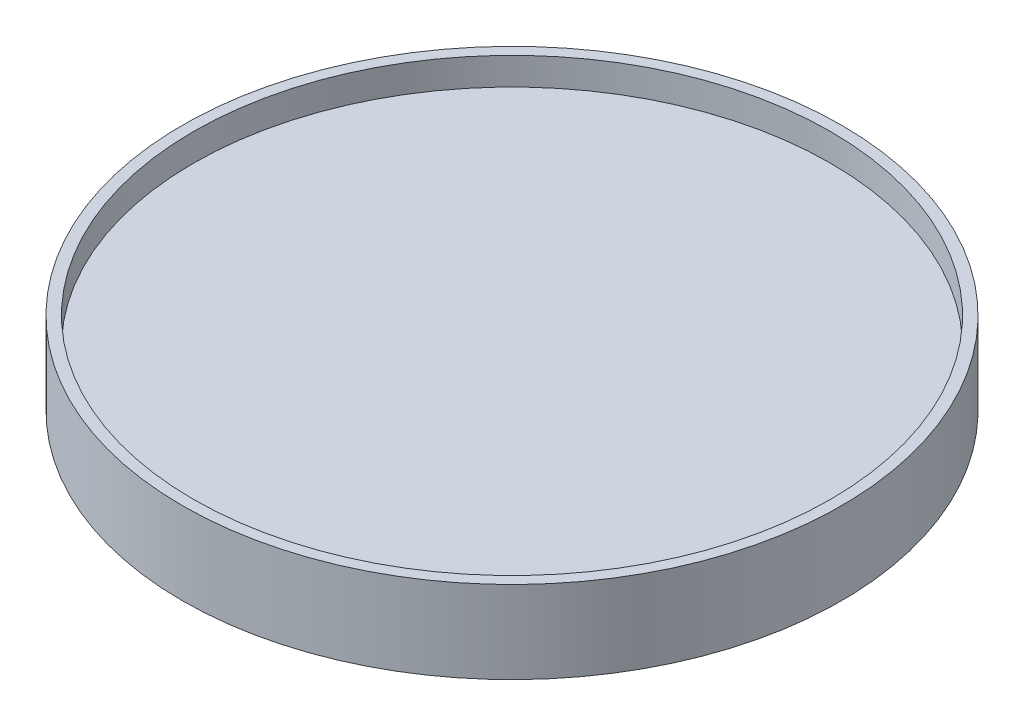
from build123d import *

# Parameters (mm, degrees)
SKETCH1_R           = 76.2
BOSS_EXTRUDE1_DEPTH = 12.7
SKETCH2_R           = 76.2
SKETCH2_R_2         = 73.66
BOSS_EXTRUDE2_DEPTH = 6.35


with BuildPart() as part:
    # Sketch1 → Boss-Extrude1 (new body)
    with BuildSketch(Plane(origin=(0, 0, 0), x_dir=(1, 0, 0), z_dir=(0, 1, 0))):
        with Locations(Location((0, 0, 0), (0, 0, 270))):
            Circle(SKETCH1_R)
    extrude(amount=BOSS_EXTRUDE1_DEPTH)

    # Sketch2 → Boss-Extrude2 (add)
    with BuildSketch(Plane(origin=(0, 12.7, 0), x_dir=(1, 0, 0), z_dir=(0, 1, 0))):
        with Locations(Location((0, 0, 0), (0, 0, 270))):
            Circle(SKETCH2_R)
        with Locations(Location((0, 0, 0), (0, 0, 270))):
            Circle(SKETCH2_R_2, mode=Mode.SUBTRACT)
    extrude(amount=BOSS_EXTRUDE2_DEPTH)


solid = part.part
